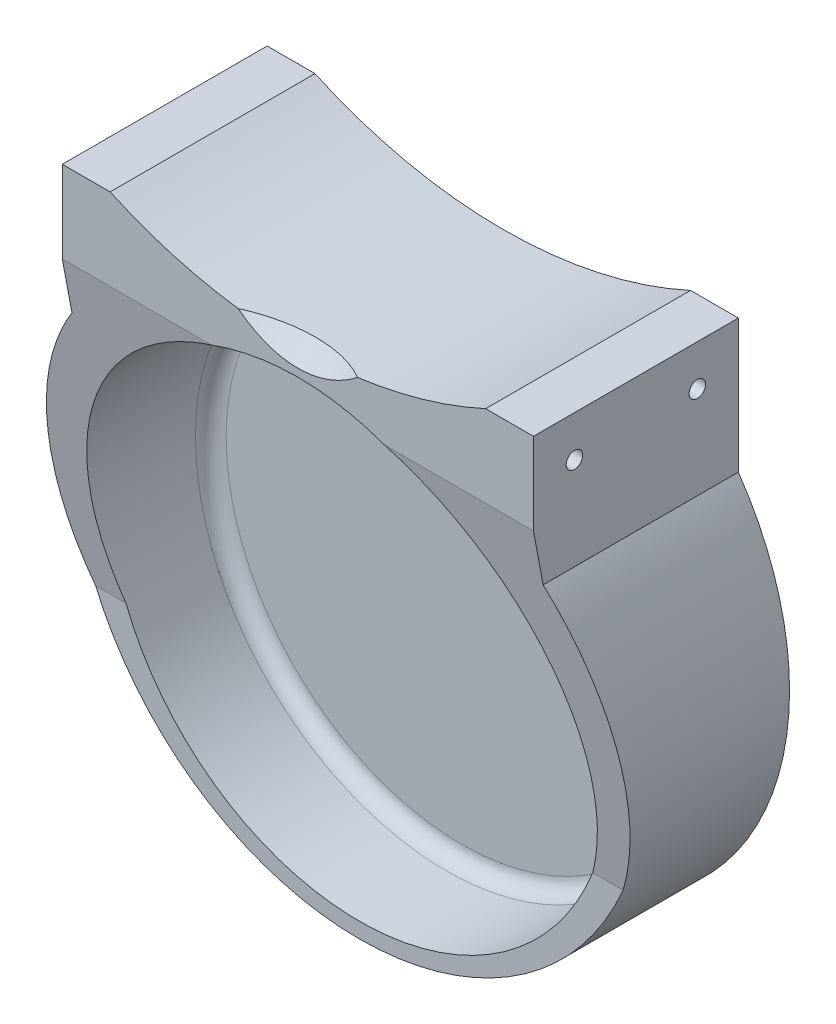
from build123d import *

# Parameters (mm, degrees)
SKETCH1_R                        = 77.7875
BOSS_EXTRUDE1_DEPTH              = 63.5
SKETCH2_R                        = 77.7875
BOSS_EXTRUDE2_DEPTH              = 12.7
FILLET7_R                        = 4.7625
F_1_4_20_TAPPED_HOLE1_AT_2_COUNT = 2
F_1_4_20_TAPPED_HOLE1_AT_2_PITCH = 38.1
SKETCH22_R                       = 139.7
CUT_EXTRUDE8_DEPTH               = 148.047409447
CUT_EXTRUDE9_DEPTH               = 200.84853327
CUT_EXTRUDE9_DEPTH_BACK          = 200.84853327
SKETCH24_R                       = 38.1
CUT_EXTRUDE10_DEPTH              = 195.855520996


with BuildPart() as part:
    # Sketch1 → Boss-Extrude1 (new body)
    with BuildSketch(Plane.XY):
        with BuildLine():
            Line((-73.025, 57.050684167), (-73.025, 98.425))
            Line((-73.025, 98.425), (73.025, 98.425))
            Line((73.025, 98.425), (73.025, 57.050684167))
            ThreePointArc((73.025, 57.050684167), (0, -82.55), (-73.025, 57.050684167))
        make_face()
        Circle(SKETCH1_R, mode=Mode.SUBTRACT)
    extrude(amount=BOSS_EXTRUDE1_DEPTH)

    # Sketch2 → Boss-Extrude2 (add)
    with BuildSketch(Plane(origin=(0, 0, 0), x_dir=(-1, 0, 0), z_dir=(0, 0, -1))):
        Circle(SKETCH2_R)
    extrude(amount=-BOSS_EXTRUDE2_DEPTH)

    # Fillet7
    fillet7_edges = [part.edges().sort_by_distance(p)[0] for p in [
        (-77.7875, 0, 12.7),
    ]]
    fillet(fillet7_edges, radius=FILLET7_R)

    # Sketch21 → 1_4-20 Tapped Hole1 (revolve, cut)
    with BuildSketch(Plane(origin=(-73.025, 85.725, 12.7), x_dir=(0, 0, 1), z_dir=(0, 1, 0))):
        Polygon((0, 0), (0, 33.283816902), (2.5527, 31.75), (2.5527, 0), align=None)
    f_1_4_20_tapped_hole1 = revolve(axis=Axis((-79.375, 85.725, 12.7), (1, 0, 0)), mode=Mode.SUBTRACT)

    # 1_4-20 Tapped Hole1 at 2: 1_4-20 Tapped Hole1 ×2
    with Locations(*[(0, 0, i * F_1_4_20_TAPPED_HOLE1_AT_2_PITCH) for i in range(1, F_1_4_20_TAPPED_HOLE1_AT_2_COUNT)]):
        add(f_1_4_20_tapped_hole1, mode=Mode.SUBTRACT)

    # Mirror1: 1_4-20 Tapped Hole1 across plane
    add(f_1_4_20_tapped_hole1.mirror(Plane(origin=(0, 0, 0), x_dir=(0, 0, 1), z_dir=(1, 0, 0))), mode=Mode.SUBTRACT)

    # Mirror1 copy 1 sketch → Mirror1 copy 1 (revolve, cut)
    with BuildSketch(Plane(origin=(73.025, 85.725, 50.8), x_dir=(0, 0, 1), z_dir=(0, 1, 0))):
        Polygon((0, 0), (0, -33.283816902), (2.5527, -31.75), (2.5527, 0), align=None)
    revolve(axis=Axis((79.375, 85.725, 50.8), (1, 0, 0)), mode=Mode.SUBTRACT)

    # Sketch22 → Cut-Extrude8 (cut, through all)
    with BuildSketch(Plane(origin=(0, 0, 0), x_dir=(-1, 0, 0), z_dir=(0, 0, -1))):
        with Locations((0, 225.425)):
            Circle(SKETCH22_R)
    extrude(amount=-CUT_EXTRUDE8_DEPTH, mode=Mode.SUBTRACT)

    # Sketch23 → Cut-Extrude9 (cut, two sides: drawn at the far end of the back side and taken through both)
    with BuildSketch(Plane(origin=(73.025, 0, 0), x_dir=(0, 0, -1), z_dir=(1, 0, 0)).offset(-CUT_EXTRUDE9_DEPTH_BACK)):
        Polygon((-63.5, 73.025), (-44.45, -28.575), (-44.45, -104.775), (-63.5, -104.775), align=None)
    extrude(amount=CUT_EXTRUDE9_DEPTH + CUT_EXTRUDE9_DEPTH_BACK, mode=Mode.SUBTRACT)

    # Sketch24 → Cut-Extrude10 (cut, through all)
    with BuildSketch(Plane(origin=(0, 49.2125, -49.2125), x_dir=(-1, 0, 0), z_dir=(0, -0.7071067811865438, 0.7071067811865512))):
        with Locations((0, -139.7)):
            Circle(SKETCH24_R)
    extrude(amount=CUT_EXTRUDE10_DEPTH, mode=Mode.SUBTRACT)


solid = part.part
